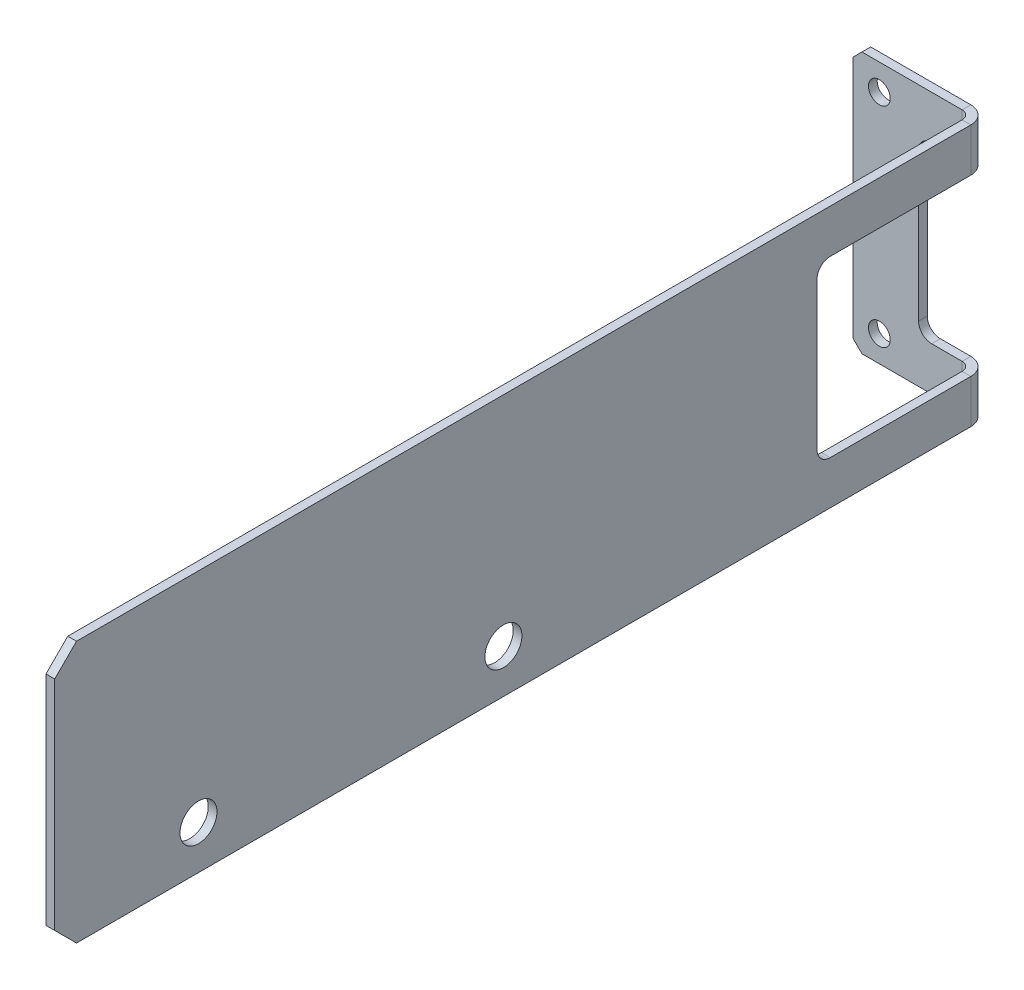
ISO-10303-21;
HEADER;
FILE_DESCRIPTION(('STEP AP214'),'2;1');
FILE_NAME('part.step','',(''),(''),'','','');
FILE_SCHEMA(('AUTOMOTIVE_DESIGN { 1 0 10303 214 1 1 1 1 }'));
ENDSEC;
DATA;
#1=APPLICATION_CONTEXT('core data for automotive mechanical design processes');
#2=APPLICATION_PROTOCOL_DEFINITION('international standard','automotive_design',2000,#1);
#3=PRODUCT_CONTEXT('',#1,'mechanical');
#4=PRODUCT('Part','Part','',(#3));
#5=PRODUCT_RELATED_PRODUCT_CATEGORY('part','',(#4));
#6=PRODUCT_DEFINITION_FORMATION('','',#4);
#7=PRODUCT_DEFINITION_CONTEXT('part definition',#1,'design');
#8=PRODUCT_DEFINITION('design','',#6,#7);
#9=PRODUCT_DEFINITION_SHAPE('','',#8);
#10=(LENGTH_UNIT() NAMED_UNIT(*) SI_UNIT(.MILLI.,.METRE.));
#11=(NAMED_UNIT(*) PLANE_ANGLE_UNIT() SI_UNIT($,.RADIAN.));
#12=(NAMED_UNIT(*) SI_UNIT($,.STERADIAN.) SOLID_ANGLE_UNIT());
#13=UNCERTAINTY_MEASURE_WITH_UNIT(LENGTH_MEASURE(1.E-05),#10,'distance_accuracy_value','');
#14=(GEOMETRIC_REPRESENTATION_CONTEXT(3) GLOBAL_UNCERTAINTY_ASSIGNED_CONTEXT((#13)) GLOBAL_UNIT_ASSIGNED_CONTEXT((#10,
#11,#12)) REPRESENTATION_CONTEXT('',''));
#15=CARTESIAN_POINT('',(0.,0.,0.));
#16=DIRECTION('',(0.,0.,1.));
#17=DIRECTION('',(1.,0.,0.));
#18=AXIS2_PLACEMENT_3D('',#15,#16,#17);
#19=CARTESIAN_POINT('',(-91.0043204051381,-20.,-7.70706857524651));
#20=DIRECTION('',(0.,-1.,0.));
#21=DIRECTION('',(0.,0.,1.));
#22=AXIS2_PLACEMENT_3D('',#19,#20,#21);
#23=PLANE('',#22);
#24=DIRECTION('',(0.,0.,-1.));
#25=VECTOR('',#24,1.);
#26=CARTESIAN_POINT('',(-91.0053204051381,-20.,-7.70706857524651));
#27=LINE('',#26,#25);
#28=CARTESIAN_POINT('',(-91.0053204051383,-20.,36.2929314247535));
#29=VERTEX_POINT('',#28);
#30=CARTESIAN_POINT('',(-91.0053204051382,-20.,4.00000000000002));
#31=VERTEX_POINT('',#30);
#32=EDGE_CURVE('E257',#29,#31,#27,.T.);
#33=ORIENTED_EDGE('',*,*,#32,.T.);
#34=DIRECTION('',(-1.,0.,0.));
#35=VECTOR('',#34,1.);
#36=CARTESIAN_POINT('',(-91.0043204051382,-20.,4.00000000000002));
#37=LINE('',#36,#35);
#38=CARTESIAN_POINT('',(-93.0053204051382,-20.,4.00000000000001));
#39=VERTEX_POINT('',#38);
#40=EDGE_CURVE('E398',#31,#39,#37,.T.);
#41=ORIENTED_EDGE('',*,*,#40,.T.);
#42=DIRECTION('',(0.,0.,1.));
#43=VECTOR('',#42,1.);
#44=CARTESIAN_POINT('',(-93.0053204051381,-20.,-7.70706857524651));
#45=LINE('',#44,#43);
#46=CARTESIAN_POINT('',(-93.0053204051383,-20.,36.2929314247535));
#47=VERTEX_POINT('',#46);
#48=EDGE_CURVE('E337',#39,#47,#45,.T.);
#49=ORIENTED_EDGE('',*,*,#48,.T.);
#50=DIRECTION('',(-1.,0.,0.));
#51=VECTOR('',#50,1.);
#52=CARTESIAN_POINT('',(-91.0043204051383,-20.,36.2929314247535));
#53=LINE('',#52,#51);
#54=EDGE_CURVE('E351',#29,#47,#53,.T.);
#55=ORIENTED_EDGE('',*,*,#54,.F.);
#56=EDGE_LOOP('',(#33,#41,#49,#55));
#57=FACE_BOUND('',#56,.T.);
#58=ADVANCED_FACE('F38',(#57),#23,.F.);
#59=CARTESIAN_POINT('',(-91.0043204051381,20.,-7.70706857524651));
#60=DIRECTION('',(0.,1.,0.));
#61=DIRECTION('',(-1.,0.,0.));
#62=AXIS2_PLACEMENT_3D('',#59,#60,#61);
#63=PLANE('',#62);
#64=DIRECTION('',(0.,0.,-1.));
#65=VECTOR('',#64,1.);
#66=CARTESIAN_POINT('',(-93.0053204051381,20.,-7.70706857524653));
#67=LINE('',#66,#65);
#68=CARTESIAN_POINT('',(-93.0053204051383,20.,36.2929314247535));
#69=VERTEX_POINT('',#68);
#70=CARTESIAN_POINT('',(-93.0053204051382,20.,4.00000000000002));
#71=VERTEX_POINT('',#70);
#72=EDGE_CURVE('E343',#69,#71,#67,.T.);
#73=ORIENTED_EDGE('',*,*,#72,.T.);
#74=DIRECTION('',(1.,0.,0.));
#75=VECTOR('',#74,1.);
#76=CARTESIAN_POINT('',(-91.0043204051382,20.,4.00000000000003));
#77=LINE('',#76,#75);
#78=CARTESIAN_POINT('',(-91.0053204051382,20.,4.00000000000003));
#79=VERTEX_POINT('',#78);
#80=EDGE_CURVE('E412',#71,#79,#77,.T.);
#81=ORIENTED_EDGE('',*,*,#80,.T.);
#82=DIRECTION('',(0.,0.,1.));
#83=VECTOR('',#82,1.);
#84=CARTESIAN_POINT('',(-91.0053204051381,20.,-7.70706857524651));
#85=LINE('',#84,#83);
#86=CARTESIAN_POINT('',(-91.0053204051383,20.,36.2929314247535));
#87=VERTEX_POINT('',#86);
#88=EDGE_CURVE('E332',#79,#87,#85,.T.);
#89=ORIENTED_EDGE('',*,*,#88,.T.);
#90=DIRECTION('',(-1.,0.,0.));
#91=VECTOR('',#90,1.);
#92=CARTESIAN_POINT('',(-91.0043204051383,20.,36.2929314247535));
#93=LINE('',#92,#91);
#94=EDGE_CURVE('E344',#87,#69,#93,.T.);
#95=ORIENTED_EDGE('',*,*,#94,.T.);
#96=EDGE_LOOP('',(#73,#81,#89,#95));
#97=FACE_BOUND('',#96,.T.);
#98=ADVANCED_FACE('F537',(#97),#63,.F.);
#99=CARTESIAN_POINT('',(-91.0053204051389,-29.9999999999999,214.292931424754));
#100=DIRECTION('',(-1.,0.,0.));
#101=DIRECTION('',(0.,0.,1.));
#102=AXIS2_PLACEMENT_3D('',#99,#100,#101);
#103=PLANE('',#102);
#104=CARTESIAN_POINT('',(-91.0053204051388,-20.,181.292931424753));
#105=DIRECTION('',(-1.,0.,0.));
#106=DIRECTION('',(0.,0.,1.));
#107=AXIS2_PLACEMENT_3D('',#104,#105,#106);
#108=CIRCLE('',#107,4.25);
#109=CARTESIAN_POINT('',(-91.0053204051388,-20.,185.542931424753));
#110=VERTEX_POINT('',#109);
#111=EDGE_CURVE('E362',#110,#110,#108,.F.);
#112=ORIENTED_EDGE('',*,*,#111,.F.);
#113=EDGE_LOOP('',(#112));
#114=FACE_BOUND('',#113,.T.);
#115=CARTESIAN_POINT('',(-91.0053204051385,-20.,111.292931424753));
#116=DIRECTION('',(-1.,0.,0.));
#117=DIRECTION('',(0.,0.,1.));
#118=AXIS2_PLACEMENT_3D('',#115,#116,#117);
#119=CIRCLE('',#118,4.25);
#120=CARTESIAN_POINT('',(-91.0053204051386,-20.,115.542931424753));
#121=VERTEX_POINT('',#120);
#122=EDGE_CURVE('E356',#121,#121,#119,.F.);
#123=ORIENTED_EDGE('',*,*,#122,.F.);
#124=EDGE_LOOP('',(#123));
#125=FACE_BOUND('',#124,.T.);
#126=DIRECTION('',(0.,0.,1.));
#127=VECTOR('',#126,1.);
#128=CARTESIAN_POINT('',(-91.0053204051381,-30.,-25.7070685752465));
#129=LINE('',#128,#127);
#130=CARTESIAN_POINT('',(-91.0053204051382,-30.,4.00000000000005));
#131=VERTEX_POINT('',#130);
#132=CARTESIAN_POINT('',(-91.0053204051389,-29.9999999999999,209.292931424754));
#133=VERTEX_POINT('',#132);
#134=EDGE_CURVE('E370',#131,#133,#129,.T.);
#135=ORIENTED_EDGE('',*,*,#134,.F.);
#136=DIRECTION('',(0.,1.,0.));
#137=VECTOR('',#136,1.);
#138=CARTESIAN_POINT('',(-91.0053204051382,-29.9999999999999,4.00000000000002));
#139=LINE('',#138,#137);
#140=EDGE_CURVE('E400',#131,#31,#139,.T.);
#141=ORIENTED_EDGE('',*,*,#140,.T.);
#142=ORIENTED_EDGE('',*,*,#32,.F.);
#143=CARTESIAN_POINT('',(-91.0053204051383,-17.,36.2929314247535));
#144=DIRECTION('',(-1.,0.,0.));
#145=DIRECTION('',(0.,0.,1.));
#146=AXIS2_PLACEMENT_3D('',#143,#144,#145);
#147=CIRCLE('',#146,3.);
#148=CARTESIAN_POINT('',(-91.0053204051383,-17.,39.2929314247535));
#149=VERTEX_POINT('',#148);
#150=EDGE_CURVE('E323',#149,#29,#147,.F.);
#151=ORIENTED_EDGE('',*,*,#150,.F.);
#152=DIRECTION('',(0.,-1.,0.));
#153=VECTOR('',#152,1.);
#154=CARTESIAN_POINT('',(-91.0053204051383,17.,39.2929314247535));
#155=LINE('',#154,#153);
#156=CARTESIAN_POINT('',(-91.0053204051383,17.,39.2929314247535));
#157=VERTEX_POINT('',#156);
#158=EDGE_CURVE('E326',#157,#149,#155,.T.);
#159=ORIENTED_EDGE('',*,*,#158,.F.);
#160=CARTESIAN_POINT('',(-91.0053204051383,17.,36.2929314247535));
#161=DIRECTION('',(-1.,0.,0.));
#162=DIRECTION('',(0.,0.,1.));
#163=AXIS2_PLACEMENT_3D('',#160,#161,#162);
#164=CIRCLE('',#163,3.);
#165=EDGE_CURVE('E329',#87,#157,#164,.F.);
#166=ORIENTED_EDGE('',*,*,#165,.F.);
#167=ORIENTED_EDGE('',*,*,#88,.F.);
#168=DIRECTION('',(0.,1.,0.));
#169=VECTOR('',#168,1.);
#170=CARTESIAN_POINT('',(-91.0053204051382,-29.9999999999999,4.00000000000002));
#171=LINE('',#170,#169);
#172=CARTESIAN_POINT('',(-91.0053204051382,30.,4.00000000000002));
#173=VERTEX_POINT('',#172);
#174=EDGE_CURVE('E409',#79,#173,#171,.T.);
#175=ORIENTED_EDGE('',*,*,#174,.T.);
#176=DIRECTION('',(0.,0.,-1.));
#177=VECTOR('',#176,1.);
#178=CARTESIAN_POINT('',(-91.0053204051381,30.,-25.7070685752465));
#179=LINE('',#178,#177);
#180=CARTESIAN_POINT('',(-91.0053204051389,30.0000000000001,209.292931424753));
#181=VERTEX_POINT('',#180);
#182=EDGE_CURVE('E373',#181,#173,#179,.T.);
#183=ORIENTED_EDGE('',*,*,#182,.F.);
#184=DIRECTION('',(0.,0.707106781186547,-0.707106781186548));
#185=VECTOR('',#184,1.);
#186=CARTESIAN_POINT('',(-91.0053204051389,30.,209.292931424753));
#187=LINE('',#186,#185);
#188=CARTESIAN_POINT('',(-91.0053204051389,25.,214.292931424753));
#189=VERTEX_POINT('',#188);
#190=EDGE_CURVE('E380',#181,#189,#187,.F.);
#191=ORIENTED_EDGE('',*,*,#190,.T.);
#192=DIRECTION('',(0.,1.,0.));
#193=VECTOR('',#192,1.);
#194=CARTESIAN_POINT('',(-91.0053204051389,30.,214.292931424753));
#195=LINE('',#194,#193);
#196=CARTESIAN_POINT('',(-91.0053204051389,-25.,214.292931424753));
#197=VERTEX_POINT('',#196);
#198=EDGE_CURVE('E365',#197,#189,#195,.T.);
#199=ORIENTED_EDGE('',*,*,#198,.F.);
#200=DIRECTION('',(0.,0.707106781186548,0.707106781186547));
#201=VECTOR('',#200,1.);
#202=CARTESIAN_POINT('',(-91.0053204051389,-24.9999999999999,214.292931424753));
#203=LINE('',#202,#201);
#204=EDGE_CURVE('E382',#197,#133,#203,.F.);
#205=ORIENTED_EDGE('',*,*,#204,.T.);
#206=EDGE_LOOP('',(#135,#141,#142,#151,#159,#166,#167,#175,#183,#191,#199,#205));
#207=FACE_BOUND('',#206,.T.);
#208=ADVANCED_FACE('F468',(#114,#125,#207),#103,.F.);
#209=CARTESIAN_POINT('',(-93.0053204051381,-30.,-25.7070685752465));
#210=DIRECTION('',(0.,1.,0.));
#211=DIRECTION('',(-1.,0.,0.));
#212=AXIS2_PLACEMENT_3D('',#209,#210,#211);
#213=PLANE('',#212);
#214=DIRECTION('',(0.,0.,1.));
#215=VECTOR('',#214,1.);
#216=CARTESIAN_POINT('',(-93.0053204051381,-30.,-25.7070685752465));
#217=LINE('',#216,#215);
#218=CARTESIAN_POINT('',(-93.0053204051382,-30.,4.00000000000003));
#219=VERTEX_POINT('',#218);
#220=CARTESIAN_POINT('',(-93.0053204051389,-29.9999999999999,209.292931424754));
#221=VERTEX_POINT('',#220);
#222=EDGE_CURVE('E377',#219,#221,#217,.T.);
#223=ORIENTED_EDGE('',*,*,#222,.F.);
#224=DIRECTION('',(1.,0.,0.));
#225=VECTOR('',#224,1.);
#226=CARTESIAN_POINT('',(-93.0053204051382,-30.,4.00000000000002));
#227=LINE('',#226,#225);
#228=EDGE_CURVE('E403',#219,#131,#227,.T.);
#229=ORIENTED_EDGE('',*,*,#228,.T.);
#230=ORIENTED_EDGE('',*,*,#134,.T.);
#231=DIRECTION('',(-1.,0.,0.));
#232=VECTOR('',#231,1.);
#233=CARTESIAN_POINT('',(-93.0053204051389,-29.9999999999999,209.292931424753));
#234=LINE('',#233,#232);
#235=EDGE_CURVE('E385',#133,#221,#234,.T.);
#236=ORIENTED_EDGE('',*,*,#235,.T.);
#237=EDGE_LOOP('',(#223,#229,#230,#236));
#238=FACE_BOUND('',#237,.T.);
#239=ADVANCED_FACE('F497',(#238),#213,.F.);
#240=CARTESIAN_POINT('',(-93.0053204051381,30.,-25.7070685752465));
#241=DIRECTION('',(0.,-1.,0.));
#242=DIRECTION('',(1.,0.,0.));
#243=AXIS2_PLACEMENT_3D('',#240,#241,#242);
#244=PLANE('',#243);
#245=ORIENTED_EDGE('',*,*,#182,.T.);
#246=DIRECTION('',(-1.,0.,0.));
#247=VECTOR('',#246,1.);
#248=CARTESIAN_POINT('',(-93.0053204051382,30.,4.00000000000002));
#249=LINE('',#248,#247);
#250=CARTESIAN_POINT('',(-93.0053204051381,30.,4.00000000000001));
#251=VERTEX_POINT('',#250);
#252=EDGE_CURVE('E407',#173,#251,#249,.T.);
#253=ORIENTED_EDGE('',*,*,#252,.T.);
#254=DIRECTION('',(0.,0.,-1.));
#255=VECTOR('',#254,1.);
#256=CARTESIAN_POINT('',(-93.0053204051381,30.,-25.7070685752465));
#257=LINE('',#256,#255);
#258=CARTESIAN_POINT('',(-93.0053204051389,30.0000000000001,209.292931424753));
#259=VERTEX_POINT('',#258);
#260=EDGE_CURVE('E369',#259,#251,#257,.T.);
#261=ORIENTED_EDGE('',*,*,#260,.F.);
#262=DIRECTION('',(1.,0.,0.));
#263=VECTOR('',#262,1.);
#264=CARTESIAN_POINT('',(-93.0053204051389,30.,209.292931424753));
#265=LINE('',#264,#263);
#266=EDGE_CURVE('E392',#259,#181,#265,.T.);
#267=ORIENTED_EDGE('',*,*,#266,.T.);
#268=EDGE_LOOP('',(#245,#253,#261,#267));
#269=FACE_BOUND('',#268,.T.);
#270=ADVANCED_FACE('F472',(#269),#244,.F.);
#271=CARTESIAN_POINT('',(-93.0053204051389,30.,214.292931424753));
#272=DIRECTION('',(0.,0.,-1.));
#273=DIRECTION('',(-1.,0.,0.));
#274=AXIS2_PLACEMENT_3D('',#271,#272,#273);
#275=PLANE('',#274);
#276=DIRECTION('',(0.,1.,0.));
#277=VECTOR('',#276,1.);
#278=CARTESIAN_POINT('',(-93.0053204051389,30.,214.292931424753));
#279=LINE('',#278,#277);
#280=CARTESIAN_POINT('',(-93.0053204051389,-25.,214.292931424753));
#281=VERTEX_POINT('',#280);
#282=CARTESIAN_POINT('',(-93.0053204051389,25.,214.292931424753));
#283=VERTEX_POINT('',#282);
#284=EDGE_CURVE('E366',#281,#283,#279,.T.);
#285=ORIENTED_EDGE('',*,*,#284,.F.);
#286=DIRECTION('',(1.,0.,0.));
#287=VECTOR('',#286,1.);
#288=CARTESIAN_POINT('',(-93.0053204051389,-24.9999999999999,214.292931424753));
#289=LINE('',#288,#287);
#290=EDGE_CURVE('E376',#281,#197,#289,.T.);
#291=ORIENTED_EDGE('',*,*,#290,.T.);
#292=ORIENTED_EDGE('',*,*,#198,.T.);
#293=DIRECTION('',(-1.,0.,0.));
#294=VECTOR('',#293,1.);
#295=CARTESIAN_POINT('',(-93.0053204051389,25.,214.292931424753));
#296=LINE('',#295,#294);
#297=EDGE_CURVE('E374',#189,#283,#296,.T.);
#298=ORIENTED_EDGE('',*,*,#297,.T.);
#299=EDGE_LOOP('',(#285,#291,#292,#298));
#300=FACE_BOUND('',#299,.T.);
#301=ADVANCED_FACE('F485',(#300),#275,.F.);
#302=CARTESIAN_POINT('',(-93.0053204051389,-29.9999999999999,214.292931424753));
#303=DIRECTION('',(-1.,0.,0.));
#304=DIRECTION('',(0.,0.,1.));
#305=AXIS2_PLACEMENT_3D('',#302,#303,#304);
#306=PLANE('',#305);
#307=DIRECTION('',(0.,1.,0.));
#308=VECTOR('',#307,1.);
#309=CARTESIAN_POINT('',(-93.0053204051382,-29.9999999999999,4.00000000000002));
#310=LINE('',#309,#308);
#311=EDGE_CURVE('E395',#219,#39,#310,.T.);
#312=ORIENTED_EDGE('',*,*,#311,.F.);
#313=ORIENTED_EDGE('',*,*,#222,.T.);
#314=DIRECTION('',(0.,-0.707106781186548,-0.707106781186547));
#315=VECTOR('',#314,1.);
#316=CARTESIAN_POINT('',(-93.0053204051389,-27.4999999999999,211.792931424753));
#317=LINE('',#316,#315);
#318=EDGE_CURVE('E390',#221,#281,#317,.F.);
#319=ORIENTED_EDGE('',*,*,#318,.T.);
#320=ORIENTED_EDGE('',*,*,#284,.T.);
#321=DIRECTION('',(0.,-0.707106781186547,0.707106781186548));
#322=VECTOR('',#321,1.);
#323=CARTESIAN_POINT('',(-93.005320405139,-2.49999999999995,241.792931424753));
#324=LINE('',#323,#322);
#325=EDGE_CURVE('E388',#283,#259,#324,.F.);
#326=ORIENTED_EDGE('',*,*,#325,.T.);
#327=ORIENTED_EDGE('',*,*,#260,.T.);
#328=DIRECTION('',(0.,1.,0.));
#329=VECTOR('',#328,1.);
#330=CARTESIAN_POINT('',(-93.0053204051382,-29.9999999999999,4.00000000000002));
#331=LINE('',#330,#329);
#332=EDGE_CURVE('E233',#71,#251,#331,.T.);
#333=ORIENTED_EDGE('',*,*,#332,.F.);
#334=ORIENTED_EDGE('',*,*,#72,.F.);
#335=CARTESIAN_POINT('',(-93.0053204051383,17.,36.2929314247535));
#336=DIRECTION('',(-1.,0.,0.));
#337=DIRECTION('',(0.,0.,-1.));
#338=AXIS2_PLACEMENT_3D('',#335,#336,#337);
#339=CIRCLE('',#338,3.);
#340=CARTESIAN_POINT('',(-93.0053204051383,17.,39.2929314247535));
#341=VERTEX_POINT('',#340);
#342=EDGE_CURVE('E340',#341,#69,#339,.T.);
#343=ORIENTED_EDGE('',*,*,#342,.F.);
#344=DIRECTION('',(0.,1.,0.));
#345=VECTOR('',#344,1.);
#346=CARTESIAN_POINT('',(-93.0053204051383,17.,39.2929314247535));
#347=LINE('',#346,#345);
#348=CARTESIAN_POINT('',(-93.0053204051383,-17.,39.2929314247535));
#349=VERTEX_POINT('',#348);
#350=EDGE_CURVE('E336',#349,#341,#347,.T.);
#351=ORIENTED_EDGE('',*,*,#350,.F.);
#352=CARTESIAN_POINT('',(-93.0053204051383,-17.,36.2929314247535));
#353=DIRECTION('',(-1.,0.,0.));
#354=DIRECTION('',(0.,0.,1.));
#355=AXIS2_PLACEMENT_3D('',#352,#353,#354);
#356=CIRCLE('',#355,3.);
#357=EDGE_CURVE('E333',#47,#349,#356,.T.);
#358=ORIENTED_EDGE('',*,*,#357,.F.);
#359=ORIENTED_EDGE('',*,*,#48,.F.);
#360=EDGE_LOOP('',(#312,#313,#319,#320,#326,#327,#333,#334,#343,#351,#358,#359));
#361=FACE_BOUND('',#360,.T.);
#362=CARTESIAN_POINT('',(-93.0053204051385,-20.,111.292931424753));
#363=DIRECTION('',(-1.,0.,0.));
#364=DIRECTION('',(0.,0.,1.));
#365=AXIS2_PLACEMENT_3D('',#362,#363,#364);
#366=CIRCLE('',#365,4.25);
#367=CARTESIAN_POINT('',(-93.0053204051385,-20.,115.542931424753));
#368=VERTEX_POINT('',#367);
#369=EDGE_CURVE('E346',#368,#368,#366,.T.);
#370=ORIENTED_EDGE('',*,*,#369,.F.);
#371=EDGE_LOOP('',(#370));
#372=FACE_BOUND('',#371,.T.);
#373=CARTESIAN_POINT('',(-93.0053204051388,-20.,181.292931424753));
#374=DIRECTION('',(-1.,0.,0.));
#375=DIRECTION('',(0.,0.,1.));
#376=AXIS2_PLACEMENT_3D('',#373,#374,#375);
#377=CIRCLE('',#376,4.25);
#378=CARTESIAN_POINT('',(-93.0053204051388,-20.,185.542931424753));
#379=VERTEX_POINT('',#378);
#380=EDGE_CURVE('E359',#379,#379,#377,.T.);
#381=ORIENTED_EDGE('',*,*,#380,.F.);
#382=EDGE_LOOP('',(#381));
#383=FACE_BOUND('',#382,.T.);
#384=ADVANCED_FACE('F475',(#361,#372,#383),#306,.T.);
#385=CARTESIAN_POINT('',(-91.0043204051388,-20.,181.292931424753));
#386=DIRECTION('',(-1.,0.,0.));
#387=DIRECTION('',(0.,0.,1.));
#388=AXIS2_PLACEMENT_3D('',#385,#386,#387);
#389=CYLINDRICAL_SURFACE('',#388,4.25);
#390=ORIENTED_EDGE('',*,*,#380,.T.);
#391=EDGE_LOOP('',(#390));
#392=FACE_BOUND('',#391,.T.);
#393=ORIENTED_EDGE('',*,*,#111,.T.);
#394=EDGE_LOOP('',(#393));
#395=FACE_BOUND('',#394,.T.);
#396=ADVANCED_FACE('F695',(#392,#395),#389,.F.);
#397=CARTESIAN_POINT('',(-91.0043204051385,-20.,111.292931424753));
#398=DIRECTION('',(-1.,0.,0.));
#399=DIRECTION('',(0.,0.,1.));
#400=AXIS2_PLACEMENT_3D('',#397,#398,#399);
#401=CYLINDRICAL_SURFACE('',#400,4.25);
#402=ORIENTED_EDGE('',*,*,#369,.T.);
#403=EDGE_LOOP('',(#402));
#404=FACE_BOUND('',#403,.T.);
#405=ORIENTED_EDGE('',*,*,#122,.T.);
#406=EDGE_LOOP('',(#405));
#407=FACE_BOUND('',#406,.T.);
#408=ADVANCED_FACE('F802',(#404,#407),#401,.F.);
#409=CARTESIAN_POINT('',(-91.0043204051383,17.,36.2929314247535));
#410=DIRECTION('',(-1.,0.,0.));
#411=DIRECTION('',(0.,0.,1.));
#412=AXIS2_PLACEMENT_3D('',#409,#410,#411);
#413=CYLINDRICAL_SURFACE('',#412,3.);
#414=ORIENTED_EDGE('',*,*,#165,.T.);
#415=DIRECTION('',(-1.,0.,0.));
#416=VECTOR('',#415,1.);
#417=CARTESIAN_POINT('',(-91.0043204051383,17.,39.2929314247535));
#418=LINE('',#417,#416);
#419=EDGE_CURVE('E347',#157,#341,#418,.T.);
#420=ORIENTED_EDGE('',*,*,#419,.T.);
#421=ORIENTED_EDGE('',*,*,#342,.T.);
#422=ORIENTED_EDGE('',*,*,#94,.F.);
#423=EDGE_LOOP('',(#414,#420,#421,#422));
#424=FACE_BOUND('',#423,.T.);
#425=ADVANCED_FACE('F791',(#424),#413,.F.);
#426=CARTESIAN_POINT('',(-91.0043204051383,17.,39.2929314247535));
#427=DIRECTION('',(0.,0.,1.));
#428=DIRECTION('',(0.,1.,0.));
#429=AXIS2_PLACEMENT_3D('',#426,#427,#428);
#430=PLANE('',#429);
#431=ORIENTED_EDGE('',*,*,#158,.T.);
#432=DIRECTION('',(-1.,0.,0.));
#433=VECTOR('',#432,1.);
#434=CARTESIAN_POINT('',(-91.0043204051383,-17.,39.2929314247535));
#435=LINE('',#434,#433);
#436=EDGE_CURVE('E349',#149,#349,#435,.T.);
#437=ORIENTED_EDGE('',*,*,#436,.T.);
#438=ORIENTED_EDGE('',*,*,#350,.T.);
#439=ORIENTED_EDGE('',*,*,#419,.F.);
#440=EDGE_LOOP('',(#431,#437,#438,#439));
#441=FACE_BOUND('',#440,.T.);
#442=ADVANCED_FACE('F780',(#441),#430,.F.);
#443=CARTESIAN_POINT('',(-91.0043204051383,-17.,36.2929314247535));
#444=DIRECTION('',(-1.,0.,0.));
#445=DIRECTION('',(0.,0.,1.));
#446=AXIS2_PLACEMENT_3D('',#443,#444,#445);
#447=CYLINDRICAL_SURFACE('',#446,3.);
#448=ORIENTED_EDGE('',*,*,#150,.T.);
#449=ORIENTED_EDGE('',*,*,#54,.T.);
#450=ORIENTED_EDGE('',*,*,#357,.T.);
#451=ORIENTED_EDGE('',*,*,#436,.F.);
#452=EDGE_LOOP('',(#448,#449,#450,#451));
#453=FACE_BOUND('',#452,.T.);
#454=ADVANCED_FACE('F771',(#453),#447,.F.);
#455=CARTESIAN_POINT('',(-93.0053204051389,-24.9999999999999,214.292931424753));
#456=DIRECTION('',(0.,0.707106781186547,-0.707106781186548));
#457=DIRECTION('',(0.,-0.707106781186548,-0.707106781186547));
#458=AXIS2_PLACEMENT_3D('',#455,#456,#457);
#459=PLANE('',#458);
#460=ORIENTED_EDGE('',*,*,#318,.F.);
#461=ORIENTED_EDGE('',*,*,#235,.F.);
#462=ORIENTED_EDGE('',*,*,#204,.F.);
#463=ORIENTED_EDGE('',*,*,#290,.F.);
#464=EDGE_LOOP('',(#460,#461,#462,#463));
#465=FACE_BOUND('',#464,.T.);
#466=ADVANCED_FACE('F489',(#465),#459,.F.);
#467=CARTESIAN_POINT('',(-93.0053204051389,30.,209.292931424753));
#468=DIRECTION('',(0.,-0.707106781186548,-0.707106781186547));
#469=DIRECTION('',(0.,-0.707106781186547,0.707106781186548));
#470=AXIS2_PLACEMENT_3D('',#467,#468,#469);
#471=PLANE('',#470);
#472=ORIENTED_EDGE('',*,*,#325,.F.);
#473=ORIENTED_EDGE('',*,*,#297,.F.);
#474=ORIENTED_EDGE('',*,*,#190,.F.);
#475=ORIENTED_EDGE('',*,*,#266,.F.);
#476=EDGE_LOOP('',(#472,#473,#474,#475));
#477=FACE_BOUND('',#476,.T.);
#478=ADVANCED_FACE('F482',(#477),#471,.F.);
#479=CARTESIAN_POINT('',(-120.,30.,2.));
#480=DIRECTION('',(1.,0.,0.));
#481=DIRECTION('',(0.,1.,0.));
#482=AXIS2_PLACEMENT_3D('',#479,#480,#481);
#483=PLANE('',#482);
#484=DIRECTION('',(0.,-1.,0.));
#485=VECTOR('',#484,1.);
#486=CARTESIAN_POINT('',(-120.,30.,0.));
#487=LINE('',#486,#485);
#488=CARTESIAN_POINT('',(-120.,28.,0.));
#489=VERTEX_POINT('',#488);
#490=CARTESIAN_POINT('',(-120.,-27.9999999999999,0.));
#491=VERTEX_POINT('',#490);
#492=EDGE_CURVE('E310',#489,#491,#487,.T.);
#493=ORIENTED_EDGE('',*,*,#492,.T.);
#494=DIRECTION('',(0.,0.,1.));
#495=VECTOR('',#494,1.);
#496=CARTESIAN_POINT('',(-120.,-27.9999999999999,2.));
#497=LINE('',#496,#495);
#498=CARTESIAN_POINT('',(-120.,-28.,2.));
#499=VERTEX_POINT('',#498);
#500=EDGE_CURVE('E59',#491,#499,#497,.T.);
#501=ORIENTED_EDGE('',*,*,#500,.T.);
#502=DIRECTION('',(0.,-1.,0.));
#503=VECTOR('',#502,1.);
#504=CARTESIAN_POINT('',(-120.,30.,2.));
#505=LINE('',#504,#503);
#506=CARTESIAN_POINT('',(-120.,28.,2.));
#507=VERTEX_POINT('',#506);
#508=EDGE_CURVE('E206',#507,#499,#505,.T.);
#509=ORIENTED_EDGE('',*,*,#508,.F.);
#510=DIRECTION('',(0.,0.,-1.));
#511=VECTOR('',#510,1.);
#512=CARTESIAN_POINT('',(-120.,28.,2.));
#513=LINE('',#512,#511);
#514=EDGE_CURVE('E432',#507,#489,#513,.T.);
#515=ORIENTED_EDGE('',*,*,#514,.T.);
#516=EDGE_LOOP('',(#493,#501,#509,#515));
#517=FACE_BOUND('',#516,.T.);
#518=ADVANCED_FACE('F452',(#517),#483,.F.);
#519=CARTESIAN_POINT('',(-102.,17.,-0.00100000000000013));
#520=DIRECTION('',(0.,0.,1.));
#521=DIRECTION('',(1.,0.,0.));
#522=AXIS2_PLACEMENT_3D('',#519,#520,#521);
#523=CYLINDRICAL_SURFACE('',#522,3.);
#524=CARTESIAN_POINT('',(-102.,17.,0.));
#525=DIRECTION('',(0.,0.,1.));
#526=DIRECTION('',(1.,0.,0.));
#527=AXIS2_PLACEMENT_3D('',#524,#525,#526);
#528=CIRCLE('',#527,3.);
#529=CARTESIAN_POINT('',(-105.,17.,0.));
#530=VERTEX_POINT('',#529);
#531=CARTESIAN_POINT('',(-102.,20.,0.));
#532=VERTEX_POINT('',#531);
#533=EDGE_CURVE('E307',#530,#532,#528,.F.);
#534=ORIENTED_EDGE('',*,*,#533,.T.);
#535=DIRECTION('',(0.,0.,1.));
#536=VECTOR('',#535,1.);
#537=CARTESIAN_POINT('',(-102.,20.,-0.00100000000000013));
#538=LINE('',#537,#536);
#539=CARTESIAN_POINT('',(-102.,20.,2.));
#540=VERTEX_POINT('',#539);
#541=EDGE_CURVE('E304',#532,#540,#538,.T.);
#542=ORIENTED_EDGE('',*,*,#541,.T.);
#543=CARTESIAN_POINT('',(-102.,17.,2.));
#544=DIRECTION('',(0.,0.,1.));
#545=DIRECTION('',(1.,0.,0.));
#546=AXIS2_PLACEMENT_3D('',#543,#544,#545);
#547=CIRCLE('',#546,3.);
#548=CARTESIAN_POINT('',(-105.,17.,2.));
#549=VERTEX_POINT('',#548);
#550=EDGE_CURVE('E302',#540,#549,#547,.T.);
#551=ORIENTED_EDGE('',*,*,#550,.T.);
#552=DIRECTION('',(0.,0.,1.));
#553=VECTOR('',#552,1.);
#554=CARTESIAN_POINT('',(-105.,17.,-0.00100000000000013));
#555=LINE('',#554,#553);
#556=EDGE_CURVE('E296',#530,#549,#555,.T.);
#557=ORIENTED_EDGE('',*,*,#556,.F.);
#558=EDGE_LOOP('',(#534,#542,#551,#557));
#559=FACE_BOUND('',#558,.T.);
#560=ADVANCED_FACE('F525',(#559),#523,.F.);
#561=CARTESIAN_POINT('',(-105.,17.,-0.00100000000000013));
#562=DIRECTION('',(-1.,0.,0.));
#563=DIRECTION('',(0.,0.,1.));
#564=AXIS2_PLACEMENT_3D('',#561,#562,#563);
#565=PLANE('',#564);
#566=DIRECTION('',(0.,1.,0.));
#567=VECTOR('',#566,1.);
#568=CARTESIAN_POINT('',(-105.,17.,0.));
#569=LINE('',#568,#567);
#570=CARTESIAN_POINT('',(-105.,-17.,0.));
#571=VERTEX_POINT('',#570);
#572=EDGE_CURVE('E299',#571,#530,#569,.T.);
#573=ORIENTED_EDGE('',*,*,#572,.T.);
#574=ORIENTED_EDGE('',*,*,#556,.T.);
#575=DIRECTION('',(0.,-1.,0.));
#576=VECTOR('',#575,1.);
#577=CARTESIAN_POINT('',(-105.,17.,2.));
#578=LINE('',#577,#576);
#579=CARTESIAN_POINT('',(-105.,-17.,2.));
#580=VERTEX_POINT('',#579);
#581=EDGE_CURVE('E293',#549,#580,#578,.T.);
#582=ORIENTED_EDGE('',*,*,#581,.T.);
#583=DIRECTION('',(0.,0.,1.));
#584=VECTOR('',#583,1.);
#585=CARTESIAN_POINT('',(-105.,-17.,-0.00100000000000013));
#586=LINE('',#585,#584);
#587=EDGE_CURVE('E289',#571,#580,#586,.T.);
#588=ORIENTED_EDGE('',*,*,#587,.F.);
#589=EDGE_LOOP('',(#573,#574,#582,#588));
#590=FACE_BOUND('',#589,.T.);
#591=ADVANCED_FACE('F522',(#590),#565,.F.);
#592=CARTESIAN_POINT('',(-102.,-17.,-0.00100000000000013));
#593=DIRECTION('',(0.,0.,1.));
#594=DIRECTION('',(1.,0.,0.));
#595=AXIS2_PLACEMENT_3D('',#592,#593,#594);
#596=CYLINDRICAL_SURFACE('',#595,3.);
#597=CARTESIAN_POINT('',(-102.,-17.,0.));
#598=DIRECTION('',(0.,0.,1.));
#599=DIRECTION('',(1.,0.,0.));
#600=AXIS2_PLACEMENT_3D('',#597,#598,#599);
#601=CIRCLE('',#600,3.);
#602=CARTESIAN_POINT('',(-102.,-20.,0.));
#603=VERTEX_POINT('',#602);
#604=EDGE_CURVE('E291',#603,#571,#601,.F.);
#605=ORIENTED_EDGE('',*,*,#604,.T.);
#606=ORIENTED_EDGE('',*,*,#587,.T.);
#607=CARTESIAN_POINT('',(-102.,-17.,2.));
#608=DIRECTION('',(0.,0.,1.));
#609=DIRECTION('',(1.,0.,0.));
#610=AXIS2_PLACEMENT_3D('',#607,#608,#609);
#611=CIRCLE('',#610,3.);
#612=CARTESIAN_POINT('',(-102.,-20.,2.));
#613=VERTEX_POINT('',#612);
#614=EDGE_CURVE('E286',#580,#613,#611,.T.);
#615=ORIENTED_EDGE('',*,*,#614,.T.);
#616=DIRECTION('',(0.,0.,1.));
#617=VECTOR('',#616,1.);
#618=CARTESIAN_POINT('',(-102.,-20.,-0.00100000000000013));
#619=LINE('',#618,#617);
#620=EDGE_CURVE('E265',#603,#613,#619,.T.);
#621=ORIENTED_EDGE('',*,*,#620,.F.);
#622=EDGE_LOOP('',(#605,#606,#615,#621));
#623=FACE_BOUND('',#622,.T.);
#624=ADVANCED_FACE('F520',(#623),#596,.F.);
#625=CARTESIAN_POINT('',(-114.,-24.,-0.00100000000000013));
#626=DIRECTION('',(0.,0.,1.));
#627=DIRECTION('',(1.,0.,0.));
#628=AXIS2_PLACEMENT_3D('',#625,#626,#627);
#629=CYLINDRICAL_SURFACE('',#628,2.5);
#630=CARTESIAN_POINT('',(-114.,-24.,2.));
#631=DIRECTION('',(0.,0.,1.));
#632=DIRECTION('',(1.,0.,0.));
#633=AXIS2_PLACEMENT_3D('',#630,#631,#632);
#634=CIRCLE('',#633,2.5);
#635=CARTESIAN_POINT('',(-111.5,-24.,2.));
#636=VERTEX_POINT('',#635);
#637=EDGE_CURVE('E283',#636,#636,#634,.T.);
#638=ORIENTED_EDGE('',*,*,#637,.T.);
#639=EDGE_LOOP('',(#638));
#640=FACE_BOUND('',#639,.T.);
#641=CARTESIAN_POINT('',(-114.,-24.,0.));
#642=DIRECTION('',(0.,0.,1.));
#643=DIRECTION('',(1.,0.,0.));
#644=AXIS2_PLACEMENT_3D('',#641,#642,#643);
#645=CIRCLE('',#644,2.5);
#646=CARTESIAN_POINT('',(-111.5,-24.,0.));
#647=VERTEX_POINT('',#646);
#648=EDGE_CURVE('E280',#647,#647,#645,.F.);
#649=ORIENTED_EDGE('',*,*,#648,.T.);
#650=EDGE_LOOP('',(#649));
#651=FACE_BOUND('',#650,.T.);
#652=ADVANCED_FACE('F583',(#640,#651),#629,.F.);
#653=CARTESIAN_POINT('',(-114.,24.,-0.00100000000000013));
#654=DIRECTION('',(0.,0.,1.));
#655=DIRECTION('',(1.,0.,0.));
#656=AXIS2_PLACEMENT_3D('',#653,#654,#655);
#657=CYLINDRICAL_SURFACE('',#656,2.50000000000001);
#658=CARTESIAN_POINT('',(-114.,24.,2.));
#659=DIRECTION('',(0.,0.,1.));
#660=DIRECTION('',(1.,0.,0.));
#661=AXIS2_PLACEMENT_3D('',#658,#659,#660);
#662=CIRCLE('',#661,2.50000000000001);
#663=CARTESIAN_POINT('',(-111.5,24.,2.));
#664=VERTEX_POINT('',#663);
#665=EDGE_CURVE('E277',#664,#664,#662,.T.);
#666=ORIENTED_EDGE('',*,*,#665,.T.);
#667=EDGE_LOOP('',(#666));
#668=FACE_BOUND('',#667,.T.);
#669=CARTESIAN_POINT('',(-114.,24.,0.));
#670=DIRECTION('',(0.,0.,1.));
#671=DIRECTION('',(1.,0.,0.));
#672=AXIS2_PLACEMENT_3D('',#669,#670,#671);
#673=CIRCLE('',#672,2.50000000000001);
#674=CARTESIAN_POINT('',(-111.5,24.,0.));
#675=VERTEX_POINT('',#674);
#676=EDGE_CURVE('E274',#675,#675,#673,.F.);
#677=ORIENTED_EDGE('',*,*,#676,.T.);
#678=EDGE_LOOP('',(#677));
#679=FACE_BOUND('',#678,.T.);
#680=ADVANCED_FACE('F586',(#668,#679),#657,.F.);
#681=CARTESIAN_POINT('',(120.,-30.,2.));
#682=DIRECTION('',(0.,0.,1.));
#683=DIRECTION('',(1.,0.,0.));
#684=AXIS2_PLACEMENT_3D('',#681,#682,#683);
#685=PLANE('',#684);
#686=ORIENTED_EDGE('',*,*,#665,.F.);
#687=EDGE_LOOP('',(#686));
#688=FACE_BOUND('',#687,.T.);
#689=ORIENTED_EDGE('',*,*,#637,.F.);
#690=EDGE_LOOP('',(#689));
#691=FACE_BOUND('',#690,.T.);
#692=ORIENTED_EDGE('',*,*,#508,.T.);
#693=DIRECTION('',(-0.707106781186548,0.707106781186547,0.));
#694=VECTOR('',#693,1.);
#695=CARTESIAN_POINT('',(1.00000000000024,-149.,2.));
#696=LINE('',#695,#694);
#697=CARTESIAN_POINT('',(-118.,-30.,2.));
#698=VERTEX_POINT('',#697);
#699=EDGE_CURVE('E46',#499,#698,#696,.F.);
#700=ORIENTED_EDGE('',*,*,#699,.T.);
#701=DIRECTION('',(1.,0.,0.));
#702=VECTOR('',#701,1.);
#703=CARTESIAN_POINT('',(-120.,-30.,2.));
#704=LINE('',#703,#702);
#705=CARTESIAN_POINT('',(-95.0053204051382,-30.,2.));
#706=VERTEX_POINT('',#705);
#707=EDGE_CURVE('E272',#698,#706,#704,.T.);
#708=ORIENTED_EDGE('',*,*,#707,.T.);
#709=DIRECTION('',(0.,1.,0.));
#710=VECTOR('',#709,1.);
#711=CARTESIAN_POINT('',(-95.0053204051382,-29.9999999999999,2.));
#712=LINE('',#711,#710);
#713=CARTESIAN_POINT('',(-95.0053204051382,-20.,2.));
#714=VERTEX_POINT('',#713);
#715=EDGE_CURVE('E218',#706,#714,#712,.T.);
#716=ORIENTED_EDGE('',*,*,#715,.T.);
#717=DIRECTION('',(1.,0.,0.));
#718=VECTOR('',#717,1.);
#719=CARTESIAN_POINT('',(-102.,-20.,2.));
#720=LINE('',#719,#718);
#721=EDGE_CURVE('E263',#613,#714,#720,.T.);
#722=ORIENTED_EDGE('',*,*,#721,.F.);
#723=ORIENTED_EDGE('',*,*,#614,.F.);
#724=ORIENTED_EDGE('',*,*,#581,.F.);
#725=ORIENTED_EDGE('',*,*,#550,.F.);
#726=DIRECTION('',(-1.,0.,0.));
#727=VECTOR('',#726,1.);
#728=CARTESIAN_POINT('',(-102.,20.,2.));
#729=LINE('',#728,#727);
#730=CARTESIAN_POINT('',(-95.0053204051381,20.,2.));
#731=VERTEX_POINT('',#730);
#732=EDGE_CURVE('E212',#731,#540,#729,.T.);
#733=ORIENTED_EDGE('',*,*,#732,.F.);
#734=DIRECTION('',(0.,1.,0.));
#735=VECTOR('',#734,1.);
#736=CARTESIAN_POINT('',(-95.0053204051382,-29.9999999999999,2.));
#737=LINE('',#736,#735);
#738=CARTESIAN_POINT('',(-95.0053204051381,30.,2.));
#739=VERTEX_POINT('',#738);
#740=EDGE_CURVE('E207',#731,#739,#737,.T.);
#741=ORIENTED_EDGE('',*,*,#740,.T.);
#742=DIRECTION('',(-1.,0.,0.));
#743=VECTOR('',#742,1.);
#744=CARTESIAN_POINT('',(-120.,30.,2.));
#745=LINE('',#744,#743);
#746=CARTESIAN_POINT('',(-118.,30.,2.));
#747=VERTEX_POINT('',#746);
#748=EDGE_CURVE('E198',#739,#747,#745,.T.);
#749=ORIENTED_EDGE('',*,*,#748,.T.);
#750=DIRECTION('',(0.707106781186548,0.707106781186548,0.));
#751=VECTOR('',#750,1.);
#752=CARTESIAN_POINT('',(-29.,119.,2.));
#753=LINE('',#752,#751);
#754=EDGE_CURVE('E436',#747,#507,#753,.F.);
#755=ORIENTED_EDGE('',*,*,#754,.T.);
#756=EDGE_LOOP('',(#692,#700,#708,#716,#722,#723,#724,#725,#733,#741,#749,#755));
#757=FACE_BOUND('',#756,.T.);
#758=ADVANCED_FACE('F210',(#688,#691,#757),#685,.T.);
#759=CARTESIAN_POINT('',(-102.,-20.,-0.00100000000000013));
#760=DIRECTION('',(0.,-1.,0.));
#761=DIRECTION('',(1.,0.,0.));
#762=AXIS2_PLACEMENT_3D('',#759,#760,#761);
#763=PLANE('',#762);
#764=DIRECTION('',(0.,0.,1.));
#765=VECTOR('',#764,1.);
#766=CARTESIAN_POINT('',(-95.0053204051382,-20.,-0.00100000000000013));
#767=LINE('',#766,#765);
#768=CARTESIAN_POINT('',(-95.0053204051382,-20.,0.));
#769=VERTEX_POINT('',#768);
#770=EDGE_CURVE('E312',#769,#714,#767,.T.);
#771=ORIENTED_EDGE('',*,*,#770,.F.);
#772=DIRECTION('',(-1.,0.,0.));
#773=VECTOR('',#772,1.);
#774=CARTESIAN_POINT('',(-102.,-20.,0.));
#775=LINE('',#774,#773);
#776=EDGE_CURVE('E267',#769,#603,#775,.T.);
#777=ORIENTED_EDGE('',*,*,#776,.T.);
#778=ORIENTED_EDGE('',*,*,#620,.T.);
#779=ORIENTED_EDGE('',*,*,#721,.T.);
#780=EDGE_LOOP('',(#771,#777,#778,#779));
#781=FACE_BOUND('',#780,.T.);
#782=ADVANCED_FACE('F514',(#781),#763,.F.);
#783=CARTESIAN_POINT('',(120.,-30.,0.));
#784=DIRECTION('',(0.,0.,1.));
#785=DIRECTION('',(1.,0.,0.));
#786=AXIS2_PLACEMENT_3D('',#783,#784,#785);
#787=PLANE('',#786);
#788=DIRECTION('',(1.,0.,0.));
#789=VECTOR('',#788,1.);
#790=CARTESIAN_POINT('',(-120.,-30.,0.));
#791=LINE('',#790,#789);
#792=CARTESIAN_POINT('',(-118.,-30.,0.));
#793=VERTEX_POINT('',#792);
#794=CARTESIAN_POINT('',(-95.0053204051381,-30.,0.));
#795=VERTEX_POINT('',#794);
#796=EDGE_CURVE('E261',#793,#795,#791,.T.);
#797=ORIENTED_EDGE('',*,*,#796,.F.);
#798=DIRECTION('',(0.707106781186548,-0.707106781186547,0.));
#799=VECTOR('',#798,1.);
#800=CARTESIAN_POINT('',(-118.,-30.,0.));
#801=LINE('',#800,#799);
#802=EDGE_CURVE('E430',#793,#491,#801,.F.);
#803=ORIENTED_EDGE('',*,*,#802,.T.);
#804=ORIENTED_EDGE('',*,*,#492,.F.);
#805=DIRECTION('',(-0.707106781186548,-0.707106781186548,0.));
#806=VECTOR('',#805,1.);
#807=CARTESIAN_POINT('',(-120.,28.,0.));
#808=LINE('',#807,#806);
#809=CARTESIAN_POINT('',(-118.,30.,0.));
#810=VERTEX_POINT('',#809);
#811=EDGE_CURVE('E428',#489,#810,#808,.F.);
#812=ORIENTED_EDGE('',*,*,#811,.T.);
#813=DIRECTION('',(-1.,0.,0.));
#814=VECTOR('',#813,1.);
#815=CARTESIAN_POINT('',(-120.,30.,0.));
#816=LINE('',#815,#814);
#817=CARTESIAN_POINT('',(-95.0053204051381,30.,0.));
#818=VERTEX_POINT('',#817);
#819=EDGE_CURVE('E259',#818,#810,#816,.T.);
#820=ORIENTED_EDGE('',*,*,#819,.F.);
#821=DIRECTION('',(0.,1.,0.));
#822=VECTOR('',#821,1.);
#823=CARTESIAN_POINT('',(-95.0053204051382,-29.9999999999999,0.));
#824=LINE('',#823,#822);
#825=CARTESIAN_POINT('',(-95.0053204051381,20.,0.));
#826=VERTEX_POINT('',#825);
#827=EDGE_CURVE('E229',#826,#818,#824,.T.);
#828=ORIENTED_EDGE('',*,*,#827,.F.);
#829=DIRECTION('',(1.,0.,0.));
#830=VECTOR('',#829,1.);
#831=CARTESIAN_POINT('',(-102.,20.,0.));
#832=LINE('',#831,#830);
#833=EDGE_CURVE('E255',#532,#826,#832,.T.);
#834=ORIENTED_EDGE('',*,*,#833,.F.);
#835=ORIENTED_EDGE('',*,*,#533,.F.);
#836=ORIENTED_EDGE('',*,*,#572,.F.);
#837=ORIENTED_EDGE('',*,*,#604,.F.);
#838=ORIENTED_EDGE('',*,*,#776,.F.);
#839=DIRECTION('',(0.,1.,0.));
#840=VECTOR('',#839,1.);
#841=CARTESIAN_POINT('',(-95.0053204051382,-29.9999999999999,0.));
#842=LINE('',#841,#840);
#843=EDGE_CURVE('E315',#795,#769,#842,.T.);
#844=ORIENTED_EDGE('',*,*,#843,.F.);
#845=EDGE_LOOP('',(#797,#803,#804,#812,#820,#828,#834,#835,#836,#837,#838,#844));
#846=FACE_BOUND('',#845,.T.);
#847=ORIENTED_EDGE('',*,*,#648,.F.);
#848=EDGE_LOOP('',(#847));
#849=FACE_BOUND('',#848,.T.);
#850=ORIENTED_EDGE('',*,*,#676,.F.);
#851=EDGE_LOOP('',(#850));
#852=FACE_BOUND('',#851,.T.);
#853=ADVANCED_FACE('F449',(#846,#849,#852),#787,.F.);
#854=CARTESIAN_POINT('',(-120.,-30.,2.));
#855=DIRECTION('',(0.,1.,0.));
#856=DIRECTION('',(0.,0.,1.));
#857=AXIS2_PLACEMENT_3D('',#854,#855,#856);
#858=PLANE('',#857);
#859=ORIENTED_EDGE('',*,*,#707,.F.);
#860=DIRECTION('',(0.,0.,-1.));
#861=VECTOR('',#860,1.);
#862=CARTESIAN_POINT('',(-118.,-30.,2.));
#863=LINE('',#862,#861);
#864=EDGE_CURVE('E415',#698,#793,#863,.T.);
#865=ORIENTED_EDGE('',*,*,#864,.T.);
#866=ORIENTED_EDGE('',*,*,#796,.T.);
#867=DIRECTION('',(0.,0.,-1.));
#868=VECTOR('',#867,1.);
#869=CARTESIAN_POINT('',(-95.0053204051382,-30.,2.));
#870=LINE('',#869,#868);
#871=EDGE_CURVE('E228',#706,#795,#870,.T.);
#872=ORIENTED_EDGE('',*,*,#871,.F.);
#873=EDGE_LOOP('',(#859,#865,#866,#872));
#874=FACE_BOUND('',#873,.T.);
#875=ADVANCED_FACE('F443',(#874),#858,.F.);
#876=CARTESIAN_POINT('',(-120.,30.,2.));
#877=DIRECTION('',(0.,-1.,0.));
#878=DIRECTION('',(0.,0.,-1.));
#879=AXIS2_PLACEMENT_3D('',#876,#877,#878);
#880=PLANE('',#879);
#881=ORIENTED_EDGE('',*,*,#819,.T.);
#882=DIRECTION('',(0.,0.,1.));
#883=VECTOR('',#882,1.);
#884=CARTESIAN_POINT('',(-118.,30.,2.));
#885=LINE('',#884,#883);
#886=EDGE_CURVE('E12',#810,#747,#885,.T.);
#887=ORIENTED_EDGE('',*,*,#886,.T.);
#888=ORIENTED_EDGE('',*,*,#748,.F.);
#889=DIRECTION('',(0.,0.,1.));
#890=VECTOR('',#889,1.);
#891=CARTESIAN_POINT('',(-95.0053204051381,30.,2.));
#892=LINE('',#891,#890);
#893=EDGE_CURVE('E202',#818,#739,#892,.T.);
#894=ORIENTED_EDGE('',*,*,#893,.F.);
#895=EDGE_LOOP('',(#881,#887,#888,#894));
#896=FACE_BOUND('',#895,.T.);
#897=ADVANCED_FACE('F200',(#896),#880,.F.);
#898=CARTESIAN_POINT('',(-102.,20.,-0.00100000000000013));
#899=DIRECTION('',(0.,1.,0.));
#900=DIRECTION('',(0.,0.,1.));
#901=AXIS2_PLACEMENT_3D('',#898,#899,#900);
#902=PLANE('',#901);
#903=DIRECTION('',(0.,0.,-1.));
#904=VECTOR('',#903,1.);
#905=CARTESIAN_POINT('',(-95.0053204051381,20.,-0.00100000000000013));
#906=LINE('',#905,#904);
#907=EDGE_CURVE('E251',#731,#826,#906,.T.);
#908=ORIENTED_EDGE('',*,*,#907,.F.);
#909=ORIENTED_EDGE('',*,*,#732,.T.);
#910=ORIENTED_EDGE('',*,*,#541,.F.);
#911=ORIENTED_EDGE('',*,*,#833,.T.);
#912=EDGE_LOOP('',(#908,#909,#910,#911));
#913=FACE_BOUND('',#912,.T.);
#914=ADVANCED_FACE('F526',(#913),#902,.F.);
#915=CARTESIAN_POINT('',(-95.0053204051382,-30.,4.));
#916=DIRECTION('',(0.,1.,0.));
#917=DIRECTION('',(0.,0.,1.));
#918=AXIS2_PLACEMENT_3D('',#915,#916,#917);
#919=PLANE('',#918);
#920=ORIENTED_EDGE('',*,*,#871,.T.);
#921=CARTESIAN_POINT('',(-95.0053204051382,-30.,4.));
#922=DIRECTION('',(0.,1.,0.));
#923=DIRECTION('',(-1.,0.,0.));
#924=AXIS2_PLACEMENT_3D('',#921,#922,#923);
#925=CIRCLE('',#924,4.);
#926=EDGE_CURVE('E234',#795,#131,#925,.F.);
#927=ORIENTED_EDGE('',*,*,#926,.T.);
#928=ORIENTED_EDGE('',*,*,#228,.F.);
#929=CARTESIAN_POINT('',(-95.0053204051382,-30.,4.));
#930=DIRECTION('',(0.,-1.,0.));
#931=DIRECTION('',(0.,0.,-1.));
#932=AXIS2_PLACEMENT_3D('',#929,#930,#931);
#933=CIRCLE('',#932,2.);
#934=EDGE_CURVE('E246',#706,#219,#933,.T.);
#935=ORIENTED_EDGE('',*,*,#934,.F.);
#936=EDGE_LOOP('',(#920,#927,#928,#935));
#937=FACE_BOUND('',#936,.T.);
#938=ADVANCED_FACE('F504',(#937),#919,.F.);
#939=CARTESIAN_POINT('',(-95.0053204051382,-20.,4.));
#940=DIRECTION('',(0.,-1.,0.));
#941=DIRECTION('',(0.,0.,-1.));
#942=AXIS2_PLACEMENT_3D('',#939,#940,#941);
#943=PLANE('',#942);
#944=CARTESIAN_POINT('',(-95.0053204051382,-20.,4.));
#945=DIRECTION('',(0.,1.,0.));
#946=DIRECTION('',(-1.,0.,0.));
#947=AXIS2_PLACEMENT_3D('',#944,#945,#946);
#948=CIRCLE('',#947,4.);
#949=EDGE_CURVE('E238',#31,#769,#948,.T.);
#950=ORIENTED_EDGE('',*,*,#949,.T.);
#951=ORIENTED_EDGE('',*,*,#770,.T.);
#952=CARTESIAN_POINT('',(-95.0053204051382,-20.,4.));
#953=DIRECTION('',(0.,1.,0.));
#954=DIRECTION('',(0.,0.,-1.));
#955=AXIS2_PLACEMENT_3D('',#952,#953,#954);
#956=CIRCLE('',#955,2.);
#957=EDGE_CURVE('E249',#39,#714,#956,.T.);
#958=ORIENTED_EDGE('',*,*,#957,.F.);
#959=ORIENTED_EDGE('',*,*,#40,.F.);
#960=EDGE_LOOP('',(#950,#951,#958,#959));
#961=FACE_BOUND('',#960,.T.);
#962=ADVANCED_FACE('F512',(#961),#943,.F.);
#963=CARTESIAN_POINT('',(-95.0053204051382,-36.2341715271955,4.));
#964=DIRECTION('',(0.,1.,0.));
#965=DIRECTION('',(-1.,0.,0.));
#966=AXIS2_PLACEMENT_3D('',#963,#964,#965);
#967=CYLINDRICAL_SURFACE('',#966,2.);
#968=ORIENTED_EDGE('',*,*,#311,.T.);
#969=ORIENTED_EDGE('',*,*,#957,.T.);
#970=ORIENTED_EDGE('',*,*,#715,.F.);
#971=ORIENTED_EDGE('',*,*,#934,.T.);
#972=EDGE_LOOP('',(#968,#969,#970,#971));
#973=FACE_BOUND('',#972,.T.);
#974=ADVANCED_FACE('F506',(#973),#967,.F.);
#975=CARTESIAN_POINT('',(-95.0053204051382,-36.2341715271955,4.));
#976=DIRECTION('',(0.,1.,0.));
#977=DIRECTION('',(-1.,0.,0.));
#978=AXIS2_PLACEMENT_3D('',#975,#976,#977);
#979=CYLINDRICAL_SURFACE('',#978,4.);
#980=ORIENTED_EDGE('',*,*,#140,.F.);
#981=ORIENTED_EDGE('',*,*,#926,.F.);
#982=ORIENTED_EDGE('',*,*,#843,.T.);
#983=ORIENTED_EDGE('',*,*,#949,.F.);
#984=EDGE_LOOP('',(#980,#981,#982,#983));
#985=FACE_BOUND('',#984,.T.);
#986=ADVANCED_FACE('F503',(#985),#979,.T.);
#987=CARTESIAN_POINT('',(-95.0053204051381,20.,4.));
#988=DIRECTION('',(0.,1.,0.));
#989=DIRECTION('',(0.,0.,1.));
#990=AXIS2_PLACEMENT_3D('',#987,#988,#989);
#991=PLANE('',#990);
#992=ORIENTED_EDGE('',*,*,#907,.T.);
#993=CARTESIAN_POINT('',(-95.0053204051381,20.,4.));
#994=DIRECTION('',(0.,1.,0.));
#995=DIRECTION('',(-1.,0.,0.));
#996=AXIS2_PLACEMENT_3D('',#993,#994,#995);
#997=CIRCLE('',#996,4.);
#998=EDGE_CURVE('E242',#826,#79,#997,.F.);
#999=ORIENTED_EDGE('',*,*,#998,.T.);
#1000=ORIENTED_EDGE('',*,*,#80,.F.);
#1001=CARTESIAN_POINT('',(-95.0053204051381,20.,4.));
#1002=DIRECTION('',(0.,-1.,0.));
#1003=DIRECTION('',(0.,0.,1.));
#1004=AXIS2_PLACEMENT_3D('',#1001,#1002,#1003);
#1005=CIRCLE('',#1004,2.);
#1006=EDGE_CURVE('E235',#731,#71,#1005,.T.);
#1007=ORIENTED_EDGE('',*,*,#1006,.F.);
#1008=EDGE_LOOP('',(#992,#999,#1000,#1007));
#1009=FACE_BOUND('',#1008,.T.);
#1010=ADVANCED_FACE('F461',(#1009),#991,.F.);
#1011=CARTESIAN_POINT('',(-95.0053204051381,30.,4.));
#1012=DIRECTION('',(0.,-1.,0.));
#1013=DIRECTION('',(0.,0.,-1.));
#1014=AXIS2_PLACEMENT_3D('',#1011,#1012,#1013);
#1015=PLANE('',#1014);
#1016=CARTESIAN_POINT('',(-95.0053204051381,30.,4.));
#1017=DIRECTION('',(0.,1.,0.));
#1018=DIRECTION('',(-1.,0.,0.));
#1019=AXIS2_PLACEMENT_3D('',#1016,#1017,#1018);
#1020=CIRCLE('',#1019,4.);
#1021=EDGE_CURVE('E227',#173,#818,#1020,.T.);
#1022=ORIENTED_EDGE('',*,*,#1021,.T.);
#1023=ORIENTED_EDGE('',*,*,#893,.T.);
#1024=CARTESIAN_POINT('',(-95.0053204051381,30.,4.));
#1025=DIRECTION('',(0.,1.,0.));
#1026=DIRECTION('',(0.,0.,1.));
#1027=AXIS2_PLACEMENT_3D('',#1024,#1025,#1026);
#1028=CIRCLE('',#1027,2.);
#1029=EDGE_CURVE('E225',#251,#739,#1028,.T.);
#1030=ORIENTED_EDGE('',*,*,#1029,.F.);
#1031=ORIENTED_EDGE('',*,*,#252,.F.);
#1032=EDGE_LOOP('',(#1022,#1023,#1030,#1031));
#1033=FACE_BOUND('',#1032,.T.);
#1034=ADVANCED_FACE('F223',(#1033),#1015,.F.);
#1035=CARTESIAN_POINT('',(-95.0053204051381,13.7658284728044,4.));
#1036=DIRECTION('',(0.,1.,0.));
#1037=DIRECTION('',(-1.,0.,0.));
#1038=AXIS2_PLACEMENT_3D('',#1035,#1036,#1037);
#1039=CYLINDRICAL_SURFACE('',#1038,2.);
#1040=ORIENTED_EDGE('',*,*,#332,.T.);
#1041=ORIENTED_EDGE('',*,*,#1029,.T.);
#1042=ORIENTED_EDGE('',*,*,#740,.F.);
#1043=ORIENTED_EDGE('',*,*,#1006,.T.);
#1044=EDGE_LOOP('',(#1040,#1041,#1042,#1043));
#1045=FACE_BOUND('',#1044,.T.);
#1046=ADVANCED_FACE('F232',(#1045),#1039,.F.);
#1047=CARTESIAN_POINT('',(-95.0053204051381,13.7658284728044,4.));
#1048=DIRECTION('',(0.,1.,0.));
#1049=DIRECTION('',(-1.,0.,0.));
#1050=AXIS2_PLACEMENT_3D('',#1047,#1048,#1049);
#1051=CYLINDRICAL_SURFACE('',#1050,4.);
#1052=ORIENTED_EDGE('',*,*,#174,.F.);
#1053=ORIENTED_EDGE('',*,*,#998,.F.);
#1054=ORIENTED_EDGE('',*,*,#827,.T.);
#1055=ORIENTED_EDGE('',*,*,#1021,.F.);
#1056=EDGE_LOOP('',(#1052,#1053,#1054,#1055));
#1057=FACE_BOUND('',#1056,.T.);
#1058=ADVANCED_FACE('F465',(#1057),#1051,.T.);
#1059=CARTESIAN_POINT('',(-118.,-30.,2.));
#1060=DIRECTION('',(0.707106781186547,0.707106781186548,0.));
#1061=DIRECTION('',(-0.707106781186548,0.707106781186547,0.));
#1062=AXIS2_PLACEMENT_3D('',#1059,#1060,#1061);
#1063=PLANE('',#1062);
#1064=ORIENTED_EDGE('',*,*,#699,.F.);
#1065=ORIENTED_EDGE('',*,*,#500,.F.);
#1066=ORIENTED_EDGE('',*,*,#802,.F.);
#1067=ORIENTED_EDGE('',*,*,#864,.F.);
#1068=EDGE_LOOP('',(#1064,#1065,#1066,#1067));
#1069=FACE_BOUND('',#1068,.T.);
#1070=ADVANCED_FACE('F446',(#1069),#1063,.F.);
#1071=CARTESIAN_POINT('',(-120.,28.,2.));
#1072=DIRECTION('',(0.707106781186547,-0.707106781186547,0.));
#1073=DIRECTION('',(0.707106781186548,0.707106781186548,0.));
#1074=AXIS2_PLACEMENT_3D('',#1071,#1072,#1073);
#1075=PLANE('',#1074);
#1076=ORIENTED_EDGE('',*,*,#754,.F.);
#1077=ORIENTED_EDGE('',*,*,#886,.F.);
#1078=ORIENTED_EDGE('',*,*,#811,.F.);
#1079=ORIENTED_EDGE('',*,*,#514,.F.);
#1080=EDGE_LOOP('',(#1076,#1077,#1078,#1079));
#1081=FACE_BOUND('',#1080,.T.);
#1082=ADVANCED_FACE('F40',(#1081),#1075,.F.);
#1083=CLOSED_SHELL('',(#58,#98,#208,#239,#270,#301,#384,#396,#408,#425,#442,#454,#466,#478,#518,
#560,#591,#624,#652,#680,#758,#782,#853,#875,#897,#914,#938,#962,#974,#986,#1010,#1034,#1046,
#1058,#1070,#1082));
#1084=MANIFOLD_SOLID_BREP('B2',#1083);
#1085=ADVANCED_BREP_SHAPE_REPRESENTATION('',(#18,#1084),#14);
#1086=SHAPE_DEFINITION_REPRESENTATION(#9,#1085);
ENDSEC;
END-ISO-10303-21;
